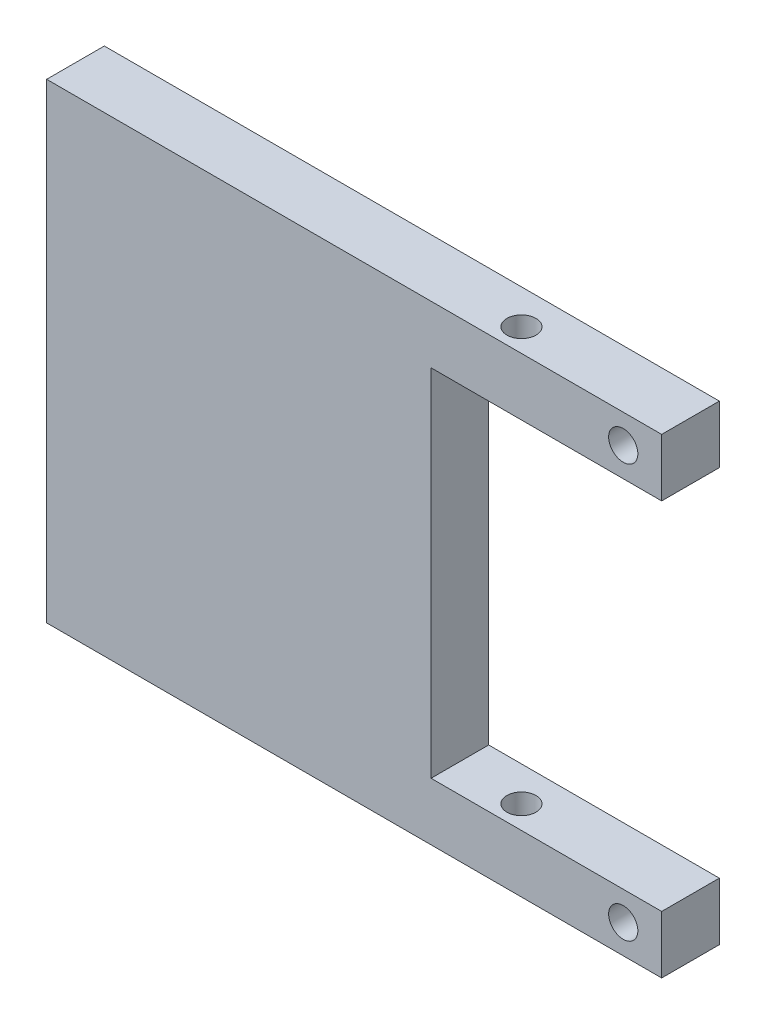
ISO-10303-21;
HEADER;
FILE_DESCRIPTION(('STEP AP214'),'2;1');
FILE_NAME('part.step','',(''),(''),'','','');
FILE_SCHEMA(('AUTOMOTIVE_DESIGN { 1 0 10303 214 1 1 1 1 }'));
ENDSEC;
DATA;
#1=APPLICATION_CONTEXT('core data for automotive mechanical design processes');
#2=APPLICATION_PROTOCOL_DEFINITION('international standard','automotive_design',2000,#1);
#3=PRODUCT_CONTEXT('',#1,'mechanical');
#4=PRODUCT('Part','Part','',(#3));
#5=PRODUCT_RELATED_PRODUCT_CATEGORY('part','',(#4));
#6=PRODUCT_DEFINITION_FORMATION('','',#4);
#7=PRODUCT_DEFINITION_CONTEXT('part definition',#1,'design');
#8=PRODUCT_DEFINITION('design','',#6,#7);
#9=PRODUCT_DEFINITION_SHAPE('','',#8);
#10=(LENGTH_UNIT() NAMED_UNIT(*) SI_UNIT(.MILLI.,.METRE.));
#11=(NAMED_UNIT(*) PLANE_ANGLE_UNIT() SI_UNIT($,.RADIAN.));
#12=(NAMED_UNIT(*) SI_UNIT($,.STERADIAN.) SOLID_ANGLE_UNIT());
#13=UNCERTAINTY_MEASURE_WITH_UNIT(LENGTH_MEASURE(1.E-05),#10,'distance_accuracy_value','');
#14=(GEOMETRIC_REPRESENTATION_CONTEXT(3) GLOBAL_UNCERTAINTY_ASSIGNED_CONTEXT((#13)) GLOBAL_UNIT_ASSIGNED_CONTEXT((#10,
#11,#12)) REPRESENTATION_CONTEXT('',''));
#15=CARTESIAN_POINT('',(0.,0.,0.));
#16=DIRECTION('',(0.,0.,1.));
#17=DIRECTION('',(1.,0.,0.));
#18=AXIS2_PLACEMENT_3D('',#15,#16,#17);
#19=CARTESIAN_POINT('',(101.6,0.,9.525));
#20=DIRECTION('',(0.,-1.,0.));
#21=DIRECTION('',(1.,0.,0.));
#22=AXIS2_PLACEMENT_3D('',#19,#20,#21);
#23=PLANE('',#22);
#24=CARTESIAN_POINT('',(74.6252,0.,5.715));
#25=DIRECTION('',(0.,1.,0.));
#26=DIRECTION('',(0.,0.,1.));
#27=AXIS2_PLACEMENT_3D('',#24,#25,#26);
#28=CIRCLE('',#27,2.40029999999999);
#29=CARTESIAN_POINT('',(74.6252,0.,8.11529999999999));
#30=VERTEX_POINT('',#29);
#31=EDGE_CURVE('E295',#30,#30,#28,.T.);
#32=ORIENTED_EDGE('',*,*,#31,.T.);
#33=EDGE_LOOP('',(#32));
#34=FACE_BOUND('',#33,.T.);
#35=DIRECTION('',(0.,0.,-1.));
#36=VECTOR('',#35,1.);
#37=CARTESIAN_POINT('',(101.6,0.,9.525));
#38=LINE('',#37,#36);
#39=CARTESIAN_POINT('',(101.6,0.,9.525));
#40=VERTEX_POINT('',#39);
#41=CARTESIAN_POINT('',(101.6,0.,0.));
#42=VERTEX_POINT('',#41);
#43=EDGE_CURVE('E11',#40,#42,#38,.T.);
#44=ORIENTED_EDGE('',*,*,#43,.F.);
#45=DIRECTION('',(-1.,0.,0.));
#46=VECTOR('',#45,1.);
#47=CARTESIAN_POINT('',(101.6,0.,9.525));
#48=LINE('',#47,#46);
#49=CARTESIAN_POINT('',(0.,0.,9.525));
#50=VERTEX_POINT('',#49);
#51=EDGE_CURVE('E104',#40,#50,#48,.T.);
#52=ORIENTED_EDGE('',*,*,#51,.T.);
#53=DIRECTION('',(0.,0.,-1.));
#54=VECTOR('',#53,1.);
#55=CARTESIAN_POINT('',(0.,0.,9.525));
#56=LINE('',#55,#54);
#57=CARTESIAN_POINT('',(0.,0.,0.));
#58=VERTEX_POINT('',#57);
#59=EDGE_CURVE('E100',#50,#58,#56,.T.);
#60=ORIENTED_EDGE('',*,*,#59,.T.);
#61=DIRECTION('',(-1.,0.,0.));
#62=VECTOR('',#61,1.);
#63=CARTESIAN_POINT('',(101.6,0.,0.));
#64=LINE('',#63,#62);
#65=EDGE_CURVE('E102',#42,#58,#64,.T.);
#66=ORIENTED_EDGE('',*,*,#65,.F.);
#67=EDGE_LOOP('',(#44,#52,#60,#66));
#68=FACE_BOUND('',#67,.T.);
#69=ADVANCED_FACE('F39',(#34,#68),#23,.T.);
#70=CARTESIAN_POINT('',(101.6,9.525,9.525));
#71=DIRECTION('',(1.,0.,0.));
#72=DIRECTION('',(0.,0.,-1.));
#73=AXIS2_PLACEMENT_3D('',#70,#71,#72);
#74=PLANE('',#73);
#75=DIRECTION('',(0.,0.,-1.));
#76=VECTOR('',#75,1.);
#77=CARTESIAN_POINT('',(101.6,9.525,9.525));
#78=LINE('',#77,#76);
#79=CARTESIAN_POINT('',(101.6,9.525,9.525));
#80=VERTEX_POINT('',#79);
#81=CARTESIAN_POINT('',(101.6,9.525,0.));
#82=VERTEX_POINT('',#81);
#83=EDGE_CURVE('E47',#80,#82,#78,.T.);
#84=ORIENTED_EDGE('',*,*,#83,.F.);
#85=DIRECTION('',(0.,-1.,0.));
#86=VECTOR('',#85,1.);
#87=CARTESIAN_POINT('',(101.6,9.525,9.525));
#88=LINE('',#87,#86);
#89=EDGE_CURVE('E110',#80,#40,#88,.T.);
#90=ORIENTED_EDGE('',*,*,#89,.T.);
#91=ORIENTED_EDGE('',*,*,#43,.T.);
#92=DIRECTION('',(0.,-1.,0.));
#93=VECTOR('',#92,1.);
#94=CARTESIAN_POINT('',(101.6,9.525,0.));
#95=LINE('',#94,#93);
#96=EDGE_CURVE('E119',#82,#42,#95,.T.);
#97=ORIENTED_EDGE('',*,*,#96,.F.);
#98=EDGE_LOOP('',(#84,#90,#91,#97));
#99=FACE_BOUND('',#98,.T.);
#100=ADVANCED_FACE('F41',(#99),#74,.T.);
#101=CARTESIAN_POINT('',(63.5,9.525,9.525));
#102=DIRECTION('',(0.,1.,0.));
#103=DIRECTION('',(-1.,0.,0.));
#104=AXIS2_PLACEMENT_3D('',#101,#102,#103);
#105=PLANE('',#104);
#106=CARTESIAN_POINT('',(74.6252,9.525,5.715));
#107=DIRECTION('',(0.,1.,0.));
#108=DIRECTION('',(-1.,0.,0.));
#109=AXIS2_PLACEMENT_3D('',#106,#107,#108);
#110=CIRCLE('',#109,2.40029999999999);
#111=CARTESIAN_POINT('',(72.2249,9.525,5.715));
#112=VERTEX_POINT('',#111);
#113=EDGE_CURVE('E120',#112,#112,#110,.T.);
#114=ORIENTED_EDGE('',*,*,#113,.F.);
#115=EDGE_LOOP('',(#114));
#116=FACE_BOUND('',#115,.T.);
#117=DIRECTION('',(0.,0.,-1.));
#118=VECTOR('',#117,1.);
#119=CARTESIAN_POINT('',(63.5,9.525,9.525));
#120=LINE('',#119,#118);
#121=CARTESIAN_POINT('',(63.5,9.525,9.525));
#122=VERTEX_POINT('',#121);
#123=CARTESIAN_POINT('',(63.5,9.525,0.));
#124=VERTEX_POINT('',#123);
#125=EDGE_CURVE('E165',#122,#124,#120,.T.);
#126=ORIENTED_EDGE('',*,*,#125,.F.);
#127=DIRECTION('',(1.,0.,0.));
#128=VECTOR('',#127,1.);
#129=CARTESIAN_POINT('',(63.5,9.525,9.525));
#130=LINE('',#129,#128);
#131=EDGE_CURVE('E155',#122,#80,#130,.T.);
#132=ORIENTED_EDGE('',*,*,#131,.T.);
#133=ORIENTED_EDGE('',*,*,#83,.T.);
#134=DIRECTION('',(1.,0.,0.));
#135=VECTOR('',#134,1.);
#136=CARTESIAN_POINT('',(63.5,9.525,0.));
#137=LINE('',#136,#135);
#138=EDGE_CURVE('E137',#124,#82,#137,.T.);
#139=ORIENTED_EDGE('',*,*,#138,.F.);
#140=EDGE_LOOP('',(#126,#132,#133,#139));
#141=FACE_BOUND('',#140,.T.);
#142=ADVANCED_FACE('F168',(#116,#141),#105,.T.);
#143=CARTESIAN_POINT('',(63.5,68.2498,9.525));
#144=DIRECTION('',(1.,0.,0.));
#145=DIRECTION('',(0.,1.,0.));
#146=AXIS2_PLACEMENT_3D('',#143,#144,#145);
#147=PLANE('',#146);
#148=DIRECTION('',(0.,0.,-1.));
#149=VECTOR('',#148,1.);
#150=CARTESIAN_POINT('',(63.5,68.2498,9.525));
#151=LINE('',#150,#149);
#152=CARTESIAN_POINT('',(63.5,68.2498,9.525));
#153=VERTEX_POINT('',#152);
#154=CARTESIAN_POINT('',(63.5,68.2498,0.));
#155=VERTEX_POINT('',#154);
#156=EDGE_CURVE('E163',#153,#155,#151,.T.);
#157=ORIENTED_EDGE('',*,*,#156,.F.);
#158=DIRECTION('',(0.,-1.,0.));
#159=VECTOR('',#158,1.);
#160=CARTESIAN_POINT('',(63.5,68.2498,9.525));
#161=LINE('',#160,#159);
#162=EDGE_CURVE('E152',#153,#122,#161,.T.);
#163=ORIENTED_EDGE('',*,*,#162,.T.);
#164=ORIENTED_EDGE('',*,*,#125,.T.);
#165=DIRECTION('',(0.,-1.,0.));
#166=VECTOR('',#165,1.);
#167=CARTESIAN_POINT('',(63.5,68.2498,0.));
#168=LINE('',#167,#166);
#169=EDGE_CURVE('E134',#155,#124,#168,.T.);
#170=ORIENTED_EDGE('',*,*,#169,.F.);
#171=EDGE_LOOP('',(#157,#163,#164,#170));
#172=FACE_BOUND('',#171,.T.);
#173=ADVANCED_FACE('F187',(#172),#147,.T.);
#174=CARTESIAN_POINT('',(101.6,68.2498,9.525));
#175=DIRECTION('',(0.,-1.,0.));
#176=DIRECTION('',(1.,0.,0.));
#177=AXIS2_PLACEMENT_3D('',#174,#175,#176);
#178=PLANE('',#177);
#179=CARTESIAN_POINT('',(74.6252,68.2498,5.715));
#180=DIRECTION('',(0.,-1.,0.));
#181=DIRECTION('',(1.,0.,0.));
#182=AXIS2_PLACEMENT_3D('',#179,#180,#181);
#183=CIRCLE('',#182,2.40029999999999);
#184=CARTESIAN_POINT('',(77.0255,68.2498,5.715));
#185=VERTEX_POINT('',#184);
#186=EDGE_CURVE('E297',#185,#185,#183,.T.);
#187=ORIENTED_EDGE('',*,*,#186,.F.);
#188=EDGE_LOOP('',(#187));
#189=FACE_BOUND('',#188,.T.);
#190=DIRECTION('',(0.,0.,-1.));
#191=VECTOR('',#190,1.);
#192=CARTESIAN_POINT('',(101.6,68.2498,9.525));
#193=LINE('',#192,#191);
#194=CARTESIAN_POINT('',(101.6,68.2498,9.525));
#195=VERTEX_POINT('',#194);
#196=CARTESIAN_POINT('',(101.6,68.2498,0.));
#197=VERTEX_POINT('',#196);
#198=EDGE_CURVE('E161',#195,#197,#193,.T.);
#199=ORIENTED_EDGE('',*,*,#198,.F.);
#200=DIRECTION('',(-1.,0.,0.));
#201=VECTOR('',#200,1.);
#202=CARTESIAN_POINT('',(101.6,68.2498,9.525));
#203=LINE('',#202,#201);
#204=EDGE_CURVE('E149',#195,#153,#203,.T.);
#205=ORIENTED_EDGE('',*,*,#204,.T.);
#206=ORIENTED_EDGE('',*,*,#156,.T.);
#207=DIRECTION('',(-1.,0.,0.));
#208=VECTOR('',#207,1.);
#209=CARTESIAN_POINT('',(101.6,68.2498,0.));
#210=LINE('',#209,#208);
#211=EDGE_CURVE('E131',#197,#155,#210,.T.);
#212=ORIENTED_EDGE('',*,*,#211,.F.);
#213=EDGE_LOOP('',(#199,#205,#206,#212));
#214=FACE_BOUND('',#213,.T.);
#215=ADVANCED_FACE('F185',(#189,#214),#178,.T.);
#216=CARTESIAN_POINT('',(101.6,77.7748,9.525));
#217=DIRECTION('',(1.,0.,0.));
#218=DIRECTION('',(0.,0.,-1.));
#219=AXIS2_PLACEMENT_3D('',#216,#217,#218);
#220=PLANE('',#219);
#221=DIRECTION('',(0.,0.,-1.));
#222=VECTOR('',#221,1.);
#223=CARTESIAN_POINT('',(101.6,77.7748,9.525));
#224=LINE('',#223,#222);
#225=CARTESIAN_POINT('',(101.6,77.7748,9.525));
#226=VERTEX_POINT('',#225);
#227=CARTESIAN_POINT('',(101.6,77.7748,0.));
#228=VERTEX_POINT('',#227);
#229=EDGE_CURVE('E159',#226,#228,#224,.T.);
#230=ORIENTED_EDGE('',*,*,#229,.F.);
#231=DIRECTION('',(0.,-1.,0.));
#232=VECTOR('',#231,1.);
#233=CARTESIAN_POINT('',(101.6,77.7748,9.525));
#234=LINE('',#233,#232);
#235=EDGE_CURVE('E146',#226,#195,#234,.T.);
#236=ORIENTED_EDGE('',*,*,#235,.T.);
#237=ORIENTED_EDGE('',*,*,#198,.T.);
#238=DIRECTION('',(0.,-1.,0.));
#239=VECTOR('',#238,1.);
#240=CARTESIAN_POINT('',(101.6,77.7748,0.));
#241=LINE('',#240,#239);
#242=EDGE_CURVE('E125',#228,#197,#241,.T.);
#243=ORIENTED_EDGE('',*,*,#242,.F.);
#244=EDGE_LOOP('',(#230,#236,#237,#243));
#245=FACE_BOUND('',#244,.T.);
#246=ADVANCED_FACE('F183',(#245),#220,.T.);
#247=CARTESIAN_POINT('',(0.,77.7748,9.525));
#248=DIRECTION('',(0.,1.,0.));
#249=DIRECTION('',(0.,0.,1.));
#250=AXIS2_PLACEMENT_3D('',#247,#248,#249);
#251=PLANE('',#250);
#252=CARTESIAN_POINT('',(74.6252,77.7748,5.715));
#253=DIRECTION('',(0.,1.,0.));
#254=DIRECTION('',(0.,0.,1.));
#255=AXIS2_PLACEMENT_3D('',#252,#253,#254);
#256=CIRCLE('',#255,2.40029999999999);
#257=CARTESIAN_POINT('',(74.6252,77.7748,8.11529999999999));
#258=VERTEX_POINT('',#257);
#259=EDGE_CURVE('E292',#258,#258,#256,.T.);
#260=ORIENTED_EDGE('',*,*,#259,.F.);
#261=EDGE_LOOP('',(#260));
#262=FACE_BOUND('',#261,.T.);
#263=DIRECTION('',(0.,0.,-1.));
#264=VECTOR('',#263,1.);
#265=CARTESIAN_POINT('',(0.,77.7748,9.525));
#266=LINE('',#265,#264);
#267=CARTESIAN_POINT('',(0.,77.7748,9.525));
#268=VERTEX_POINT('',#267);
#269=CARTESIAN_POINT('',(0.,77.7748,0.));
#270=VERTEX_POINT('',#269);
#271=EDGE_CURVE('E109',#268,#270,#266,.T.);
#272=ORIENTED_EDGE('',*,*,#271,.F.);
#273=DIRECTION('',(1.,0.,0.));
#274=VECTOR('',#273,1.);
#275=CARTESIAN_POINT('',(0.,77.7748,9.525));
#276=LINE('',#275,#274);
#277=EDGE_CURVE('E143',#268,#226,#276,.T.);
#278=ORIENTED_EDGE('',*,*,#277,.T.);
#279=ORIENTED_EDGE('',*,*,#229,.T.);
#280=DIRECTION('',(1.,0.,0.));
#281=VECTOR('',#280,1.);
#282=CARTESIAN_POINT('',(0.,77.7748,0.));
#283=LINE('',#282,#281);
#284=EDGE_CURVE('E123',#270,#228,#283,.T.);
#285=ORIENTED_EDGE('',*,*,#284,.F.);
#286=EDGE_LOOP('',(#272,#278,#279,#285));
#287=FACE_BOUND('',#286,.T.);
#288=ADVANCED_FACE('F179',(#262,#287),#251,.T.);
#289=CARTESIAN_POINT('',(0.,0.,9.525));
#290=DIRECTION('',(-1.,0.,0.));
#291=DIRECTION('',(0.,0.,1.));
#292=AXIS2_PLACEMENT_3D('',#289,#290,#291);
#293=PLANE('',#292);
#294=DIRECTION('',(0.,1.,0.));
#295=VECTOR('',#294,1.);
#296=CARTESIAN_POINT('',(0.,0.,9.525));
#297=LINE('',#296,#295);
#298=EDGE_CURVE('E141',#50,#268,#297,.T.);
#299=ORIENTED_EDGE('',*,*,#298,.T.);
#300=ORIENTED_EDGE('',*,*,#271,.T.);
#301=DIRECTION('',(0.,1.,0.));
#302=VECTOR('',#301,1.);
#303=CARTESIAN_POINT('',(0.,0.,0.));
#304=LINE('',#303,#302);
#305=EDGE_CURVE('E116',#58,#270,#304,.T.);
#306=ORIENTED_EDGE('',*,*,#305,.F.);
#307=ORIENTED_EDGE('',*,*,#59,.F.);
#308=EDGE_LOOP('',(#299,#300,#306,#307));
#309=FACE_BOUND('',#308,.T.);
#310=ADVANCED_FACE('F122',(#309),#293,.T.);
#311=CARTESIAN_POINT('',(0.,0.,9.525));
#312=DIRECTION('',(0.,0.,-1.));
#313=DIRECTION('',(-1.,0.,0.));
#314=AXIS2_PLACEMENT_3D('',#311,#312,#313);
#315=PLANE('',#314);
#316=CARTESIAN_POINT('',(95.25,73.025,9.525));
#317=DIRECTION('',(0.,0.,1.));
#318=DIRECTION('',(1.,0.,0.));
#319=AXIS2_PLACEMENT_3D('',#316,#317,#318);
#320=CIRCLE('',#319,2.41299999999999);
#321=CARTESIAN_POINT('',(97.663,73.025,9.525));
#322=VERTEX_POINT('',#321);
#323=EDGE_CURVE('E282',#322,#322,#320,.T.);
#324=ORIENTED_EDGE('',*,*,#323,.F.);
#325=EDGE_LOOP('',(#324));
#326=FACE_BOUND('',#325,.T.);
#327=CARTESIAN_POINT('',(95.25,4.7752,9.525));
#328=DIRECTION('',(0.,0.,-1.));
#329=DIRECTION('',(-1.,0.,0.));
#330=AXIS2_PLACEMENT_3D('',#327,#328,#329);
#331=CIRCLE('',#330,2.413);
#332=CARTESIAN_POINT('',(92.837,4.7752,9.525));
#333=VERTEX_POINT('',#332);
#334=EDGE_CURVE('E289',#333,#333,#331,.T.);
#335=ORIENTED_EDGE('',*,*,#334,.T.);
#336=EDGE_LOOP('',(#335));
#337=FACE_BOUND('',#336,.T.);
#338=ORIENTED_EDGE('',*,*,#51,.F.);
#339=ORIENTED_EDGE('',*,*,#89,.F.);
#340=ORIENTED_EDGE('',*,*,#131,.F.);
#341=ORIENTED_EDGE('',*,*,#162,.F.);
#342=ORIENTED_EDGE('',*,*,#204,.F.);
#343=ORIENTED_EDGE('',*,*,#235,.F.);
#344=ORIENTED_EDGE('',*,*,#277,.F.);
#345=ORIENTED_EDGE('',*,*,#298,.F.);
#346=EDGE_LOOP('',(#338,#339,#340,#341,#342,#343,#344,#345));
#347=FACE_BOUND('',#346,.T.);
#348=ADVANCED_FACE('F173',(#326,#337,#347),#315,.F.);
#349=CARTESIAN_POINT('',(0.,0.,0.));
#350=DIRECTION('',(0.,0.,-1.));
#351=DIRECTION('',(-1.,0.,0.));
#352=AXIS2_PLACEMENT_3D('',#349,#350,#351);
#353=PLANE('',#352);
#354=CARTESIAN_POINT('',(95.25,73.025,0.));
#355=DIRECTION('',(0.,0.,1.));
#356=DIRECTION('',(1.,0.,0.));
#357=AXIS2_PLACEMENT_3D('',#354,#355,#356);
#358=CIRCLE('',#357,2.41299999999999);
#359=CARTESIAN_POINT('',(97.663,73.025,0.));
#360=VERTEX_POINT('',#359);
#361=EDGE_CURVE('E279',#360,#360,#358,.T.);
#362=ORIENTED_EDGE('',*,*,#361,.T.);
#363=EDGE_LOOP('',(#362));
#364=FACE_BOUND('',#363,.T.);
#365=CARTESIAN_POINT('',(95.25,4.7752,0.));
#366=DIRECTION('',(0.,0.,-1.));
#367=DIRECTION('',(-1.,0.,0.));
#368=AXIS2_PLACEMENT_3D('',#365,#366,#367);
#369=CIRCLE('',#368,2.413);
#370=CARTESIAN_POINT('',(92.837,4.7752,0.));
#371=VERTEX_POINT('',#370);
#372=EDGE_CURVE('E284',#371,#371,#369,.T.);
#373=ORIENTED_EDGE('',*,*,#372,.F.);
#374=EDGE_LOOP('',(#373));
#375=FACE_BOUND('',#374,.T.);
#376=ORIENTED_EDGE('',*,*,#65,.T.);
#377=ORIENTED_EDGE('',*,*,#305,.T.);
#378=ORIENTED_EDGE('',*,*,#284,.T.);
#379=ORIENTED_EDGE('',*,*,#242,.T.);
#380=ORIENTED_EDGE('',*,*,#211,.T.);
#381=ORIENTED_EDGE('',*,*,#169,.T.);
#382=ORIENTED_EDGE('',*,*,#138,.T.);
#383=ORIENTED_EDGE('',*,*,#96,.T.);
#384=EDGE_LOOP('',(#376,#377,#378,#379,#380,#381,#382,#383));
#385=FACE_BOUND('',#384,.T.);
#386=ADVANCED_FACE('F114',(#364,#375,#385),#353,.T.);
#387=CARTESIAN_POINT('',(74.6252,0.,5.715));
#388=DIRECTION('',(0.,1.,0.));
#389=DIRECTION('',(0.,0.,1.));
#390=AXIS2_PLACEMENT_3D('',#387,#388,#389);
#391=CYLINDRICAL_SURFACE('',#390,2.40029999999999);
#392=ORIENTED_EDGE('',*,*,#186,.T.);
#393=EDGE_LOOP('',(#392));
#394=FACE_BOUND('',#393,.T.);
#395=ORIENTED_EDGE('',*,*,#259,.T.);
#396=EDGE_LOOP('',(#395));
#397=FACE_BOUND('',#396,.T.);
#398=ADVANCED_FACE('F236',(#394,#397),#391,.F.);
#399=ORIENTED_EDGE('',*,*,#113,.T.);
#400=EDGE_LOOP('',(#399));
#401=FACE_BOUND('',#400,.T.);
#402=ORIENTED_EDGE('',*,*,#31,.F.);
#403=EDGE_LOOP('',(#402));
#404=FACE_BOUND('',#403,.T.);
#405=ADVANCED_FACE('F250',(#401,#404),#391,.F.);
#406=CARTESIAN_POINT('',(95.25,4.7752,9.525));
#407=DIRECTION('',(0.,0.,-1.));
#408=DIRECTION('',(-1.,0.,0.));
#409=AXIS2_PLACEMENT_3D('',#406,#407,#408);
#410=CYLINDRICAL_SURFACE('',#409,2.413);
#411=CARTESIAN_POINT('',(92.837,4.7752,9.525));
#412=CARTESIAN_POINT('',(92.837,4.7752,9.42578125));
#413=CARTESIAN_POINT('',(92.837,4.7752,9.3265625));
#414=CARTESIAN_POINT('',(92.837,4.7752,9.128125));
#415=CARTESIAN_POINT('',(92.837,4.7752,9.02890625));
#416=CARTESIAN_POINT('',(92.837,4.7752,8.83046875));
#417=CARTESIAN_POINT('',(92.837,4.7752,8.73125));
#418=CARTESIAN_POINT('',(92.837,4.7752,8.5328125));
#419=CARTESIAN_POINT('',(92.837,4.7752,8.43359375));
#420=CARTESIAN_POINT('',(92.837,4.7752,8.23515625));
#421=CARTESIAN_POINT('',(92.837,4.7752,8.1359375));
#422=CARTESIAN_POINT('',(92.837,4.7752,7.9375));
#423=CARTESIAN_POINT('',(92.837,4.7752,7.83828125));
#424=CARTESIAN_POINT('',(92.837,4.7752,7.63984375));
#425=CARTESIAN_POINT('',(92.837,4.7752,7.540625));
#426=CARTESIAN_POINT('',(92.837,4.7752,7.3421875));
#427=CARTESIAN_POINT('',(92.837,4.7752,7.24296875));
#428=CARTESIAN_POINT('',(92.837,4.7752,7.04453125));
#429=CARTESIAN_POINT('',(92.837,4.7752,6.9453125));
#430=CARTESIAN_POINT('',(92.837,4.7752,6.746875));
#431=CARTESIAN_POINT('',(92.837,4.7752,6.64765625));
#432=CARTESIAN_POINT('',(92.837,4.7752,6.44921875));
#433=CARTESIAN_POINT('',(92.837,4.7752,6.35));
#434=CARTESIAN_POINT('',(92.837,4.7752,6.1515625));
#435=CARTESIAN_POINT('',(92.837,4.7752,6.05234375));
#436=CARTESIAN_POINT('',(92.837,4.7752,5.85390625));
#437=CARTESIAN_POINT('',(92.837,4.7752,5.7546875));
#438=CARTESIAN_POINT('',(92.837,4.7752,5.55625));
#439=CARTESIAN_POINT('',(92.837,4.7752,5.45703125));
#440=CARTESIAN_POINT('',(92.837,4.7752,5.25859375));
#441=CARTESIAN_POINT('',(92.837,4.7752,5.159375));
#442=CARTESIAN_POINT('',(92.837,4.7752,4.9609375));
#443=CARTESIAN_POINT('',(92.837,4.7752,4.86171875));
#444=CARTESIAN_POINT('',(92.837,4.7752,4.66328125));
#445=CARTESIAN_POINT('',(92.837,4.7752,4.5640625));
#446=CARTESIAN_POINT('',(92.837,4.7752,4.365625));
#447=CARTESIAN_POINT('',(92.837,4.7752,4.26640625));
#448=CARTESIAN_POINT('',(92.837,4.7752,4.06796875));
#449=CARTESIAN_POINT('',(92.837,4.7752,3.96875));
#450=CARTESIAN_POINT('',(92.837,4.7752,3.7703125));
#451=CARTESIAN_POINT('',(92.837,4.7752,3.67109375));
#452=CARTESIAN_POINT('',(92.837,4.7752,3.47265625));
#453=CARTESIAN_POINT('',(92.837,4.7752,3.3734375));
#454=CARTESIAN_POINT('',(92.837,4.7752,3.175));
#455=CARTESIAN_POINT('',(92.837,4.7752,3.07578125));
#456=CARTESIAN_POINT('',(92.837,4.7752,2.87734375));
#457=CARTESIAN_POINT('',(92.837,4.7752,2.778125));
#458=CARTESIAN_POINT('',(92.837,4.7752,2.5796875));
#459=CARTESIAN_POINT('',(92.837,4.7752,2.48046875));
#460=CARTESIAN_POINT('',(92.837,4.7752,2.28203125));
#461=CARTESIAN_POINT('',(92.837,4.7752,2.1828125));
#462=CARTESIAN_POINT('',(92.837,4.7752,1.984375));
#463=CARTESIAN_POINT('',(92.837,4.7752,1.88515625));
#464=CARTESIAN_POINT('',(92.837,4.7752,1.68671875));
#465=CARTESIAN_POINT('',(92.837,4.7752,1.5875));
#466=CARTESIAN_POINT('',(92.837,4.7752,1.3890625));
#467=CARTESIAN_POINT('',(92.837,4.7752,1.28984375));
#468=CARTESIAN_POINT('',(92.837,4.7752,1.09140625));
#469=CARTESIAN_POINT('',(92.837,4.7752,0.992187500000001));
#470=CARTESIAN_POINT('',(92.837,4.7752,0.793750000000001));
#471=CARTESIAN_POINT('',(92.837,4.7752,0.69453125));
#472=CARTESIAN_POINT('',(92.837,4.7752,0.49609375));
#473=CARTESIAN_POINT('',(92.837,4.7752,0.396875));
#474=CARTESIAN_POINT('',(92.837,4.7752,0.1984375));
#475=CARTESIAN_POINT('',(92.837,4.7752,0.0992187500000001));
#476=CARTESIAN_POINT('',(92.837,4.7752,0.));
#477=B_SPLINE_CURVE_WITH_KNOTS('',3,(#411,#412,#413,#414,#415,#416,#417,#418,#419,#420,#421,
#422,#423,#424,#425,#426,#427,#428,#429,#430,#431,#432,#433,#434,#435,#436,#437,#438,#439,#440,
#441,#442,#443,#444,#445,#446,#447,#448,#449,#450,#451,#452,#453,#454,#455,#456,#457,#458,#459,
#460,#461,#462,#463,#464,#465,#466,#467,#468,#469,#470,#471,#472,#473,#474,#475,#476),
.UNSPECIFIED.,.F.,.F.,(4,2,2,2,2,2,2,2,2,2,2,2,2,2,2,2,2,2,2,2,2,2,2,2,2,2,2,2,2,2,2,2,4),(0.,
0.297656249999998,0.595312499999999,0.892968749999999,1.190625,1.48828125,1.7859375,2.08359375,
2.38125,2.67890625,2.9765625,3.27421875,3.571875,3.86953125,4.1671875,4.46484375,4.7625,
5.06015625,5.3578125,5.65546875,5.953125,6.25078125,6.5484375,6.84609375,7.14375,7.44140625,
7.7390625,8.03671875,8.334375,8.63203125,8.9296875,9.22734375,9.525),.UNSPECIFIED.);
#478=EDGE_CURVE('BSEAM258',#333,#371,#477,.T.);
#479=ORIENTED_EDGE('',*,*,#334,.F.);
#480=ORIENTED_EDGE('',*,*,#372,.T.);
#481=ORIENTED_EDGE('',*,*,#478,.T.);
#482=ORIENTED_EDGE('',*,*,#478,.F.);
#483=EDGE_LOOP('',(#479,#481,#480,#482));
#484=FACE_BOUND('',#483,.T.);
#485=ADVANCED_FACE('F258',(#484),#410,.F.);
#486=CARTESIAN_POINT('',(95.25,73.025,0.));
#487=DIRECTION('',(0.,0.,1.));
#488=DIRECTION('',(1.,0.,0.));
#489=AXIS2_PLACEMENT_3D('',#486,#487,#488);
#490=CYLINDRICAL_SURFACE('',#489,2.41299999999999);
#491=CARTESIAN_POINT('',(97.663,73.025,0.));
#492=CARTESIAN_POINT('',(97.663,73.025,0.0992187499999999));
#493=CARTESIAN_POINT('',(97.663,73.025,0.1984375));
#494=CARTESIAN_POINT('',(97.663,73.025,0.396875));
#495=CARTESIAN_POINT('',(97.663,73.025,0.49609375));
#496=CARTESIAN_POINT('',(97.663,73.025,0.69453125));
#497=CARTESIAN_POINT('',(97.663,73.025,0.79375));
#498=CARTESIAN_POINT('',(97.663,73.025,0.9921875));
#499=CARTESIAN_POINT('',(97.663,73.025,1.09140625));
#500=CARTESIAN_POINT('',(97.663,73.025,1.28984375));
#501=CARTESIAN_POINT('',(97.663,73.025,1.3890625));
#502=CARTESIAN_POINT('',(97.663,73.025,1.5875));
#503=CARTESIAN_POINT('',(97.663,73.025,1.68671875));
#504=CARTESIAN_POINT('',(97.663,73.025,1.88515625));
#505=CARTESIAN_POINT('',(97.663,73.025,1.984375));
#506=CARTESIAN_POINT('',(97.663,73.025,2.1828125));
#507=CARTESIAN_POINT('',(97.663,73.025,2.28203125));
#508=CARTESIAN_POINT('',(97.663,73.025,2.48046875));
#509=CARTESIAN_POINT('',(97.663,73.025,2.5796875));
#510=CARTESIAN_POINT('',(97.663,73.025,2.778125));
#511=CARTESIAN_POINT('',(97.663,73.025,2.87734375));
#512=CARTESIAN_POINT('',(97.663,73.025,3.07578125));
#513=CARTESIAN_POINT('',(97.663,73.025,3.175));
#514=CARTESIAN_POINT('',(97.663,73.025,3.3734375));
#515=CARTESIAN_POINT('',(97.663,73.025,3.47265625));
#516=CARTESIAN_POINT('',(97.663,73.025,3.67109375));
#517=CARTESIAN_POINT('',(97.663,73.025,3.7703125));
#518=CARTESIAN_POINT('',(97.663,73.025,3.96875));
#519=CARTESIAN_POINT('',(97.663,73.025,4.06796875));
#520=CARTESIAN_POINT('',(97.663,73.025,4.26640625));
#521=CARTESIAN_POINT('',(97.663,73.025,4.365625));
#522=CARTESIAN_POINT('',(97.663,73.025,4.5640625));
#523=CARTESIAN_POINT('',(97.663,73.025,4.66328125));
#524=CARTESIAN_POINT('',(97.663,73.025,4.86171875));
#525=CARTESIAN_POINT('',(97.663,73.025,4.9609375));
#526=CARTESIAN_POINT('',(97.663,73.025,5.159375));
#527=CARTESIAN_POINT('',(97.663,73.025,5.25859375));
#528=CARTESIAN_POINT('',(97.663,73.025,5.45703125));
#529=CARTESIAN_POINT('',(97.663,73.025,5.55625));
#530=CARTESIAN_POINT('',(97.663,73.025,5.7546875));
#531=CARTESIAN_POINT('',(97.663,73.025,5.85390625));
#532=CARTESIAN_POINT('',(97.663,73.025,6.05234375));
#533=CARTESIAN_POINT('',(97.663,73.025,6.1515625));
#534=CARTESIAN_POINT('',(97.663,73.025,6.35));
#535=CARTESIAN_POINT('',(97.663,73.025,6.44921875));
#536=CARTESIAN_POINT('',(97.663,73.025,6.64765625));
#537=CARTESIAN_POINT('',(97.663,73.025,6.746875));
#538=CARTESIAN_POINT('',(97.663,73.025,6.9453125));
#539=CARTESIAN_POINT('',(97.663,73.025,7.04453125));
#540=CARTESIAN_POINT('',(97.663,73.025,7.24296875));
#541=CARTESIAN_POINT('',(97.663,73.025,7.3421875));
#542=CARTESIAN_POINT('',(97.663,73.025,7.540625));
#543=CARTESIAN_POINT('',(97.663,73.025,7.63984375));
#544=CARTESIAN_POINT('',(97.663,73.025,7.83828125));
#545=CARTESIAN_POINT('',(97.663,73.025,7.9375));
#546=CARTESIAN_POINT('',(97.663,73.025,8.1359375));
#547=CARTESIAN_POINT('',(97.663,73.025,8.23515625));
#548=CARTESIAN_POINT('',(97.663,73.025,8.43359375));
#549=CARTESIAN_POINT('',(97.663,73.025,8.5328125));
#550=CARTESIAN_POINT('',(97.663,73.025,8.73125));
#551=CARTESIAN_POINT('',(97.663,73.025,8.83046875));
#552=CARTESIAN_POINT('',(97.663,73.025,9.02890625));
#553=CARTESIAN_POINT('',(97.663,73.025,9.128125));
#554=CARTESIAN_POINT('',(97.663,73.025,9.3265625));
#555=CARTESIAN_POINT('',(97.663,73.025,9.42578125));
#556=CARTESIAN_POINT('',(97.663,73.025,9.525));
#557=B_SPLINE_CURVE_WITH_KNOTS('',3,(#491,#492,#493,#494,#495,#496,#497,#498,#499,#500,#501,
#502,#503,#504,#505,#506,#507,#508,#509,#510,#511,#512,#513,#514,#515,#516,#517,#518,#519,#520,
#521,#522,#523,#524,#525,#526,#527,#528,#529,#530,#531,#532,#533,#534,#535,#536,#537,#538,#539,
#540,#541,#542,#543,#544,#545,#546,#547,#548,#549,#550,#551,#552,#553,#554,#555,#556),
.UNSPECIFIED.,.F.,.F.,(4,2,2,2,2,2,2,2,2,2,2,2,2,2,2,2,2,2,2,2,2,2,2,2,2,2,2,2,2,2,2,2,4),(0.,
0.29765625,0.5953125,0.89296875,1.190625,1.48828125,1.7859375,2.08359375,2.38125,2.67890625,
2.9765625,3.27421875,3.571875,3.86953125,4.1671875,4.46484375,4.7625,5.06015625,5.3578125,
5.65546875,5.953125,6.25078125,6.5484375,6.84609375,7.14375,7.44140625,7.7390625,8.03671875,
8.334375,8.63203125,8.9296875,9.22734375,9.525),.UNSPECIFIED.);
#558=EDGE_CURVE('BSEAM265',#360,#322,#557,.T.);
#559=ORIENTED_EDGE('',*,*,#361,.F.);
#560=ORIENTED_EDGE('',*,*,#323,.T.);
#561=ORIENTED_EDGE('',*,*,#558,.T.);
#562=ORIENTED_EDGE('',*,*,#558,.F.);
#563=EDGE_LOOP('',(#559,#561,#560,#562));
#564=FACE_BOUND('',#563,.T.);
#565=ADVANCED_FACE('F265',(#564),#490,.F.);
#566=CLOSED_SHELL('',(#69,#100,#142,#173,#215,#246,#288,#310,#348,#386,#398,#405,#485,#565));
#567=MANIFOLD_SOLID_BREP('B2',#566);
#568=ADVANCED_BREP_SHAPE_REPRESENTATION('',(#18,#567),#14);
#569=SHAPE_DEFINITION_REPRESENTATION(#9,#568);
ENDSEC;
END-ISO-10303-21;
